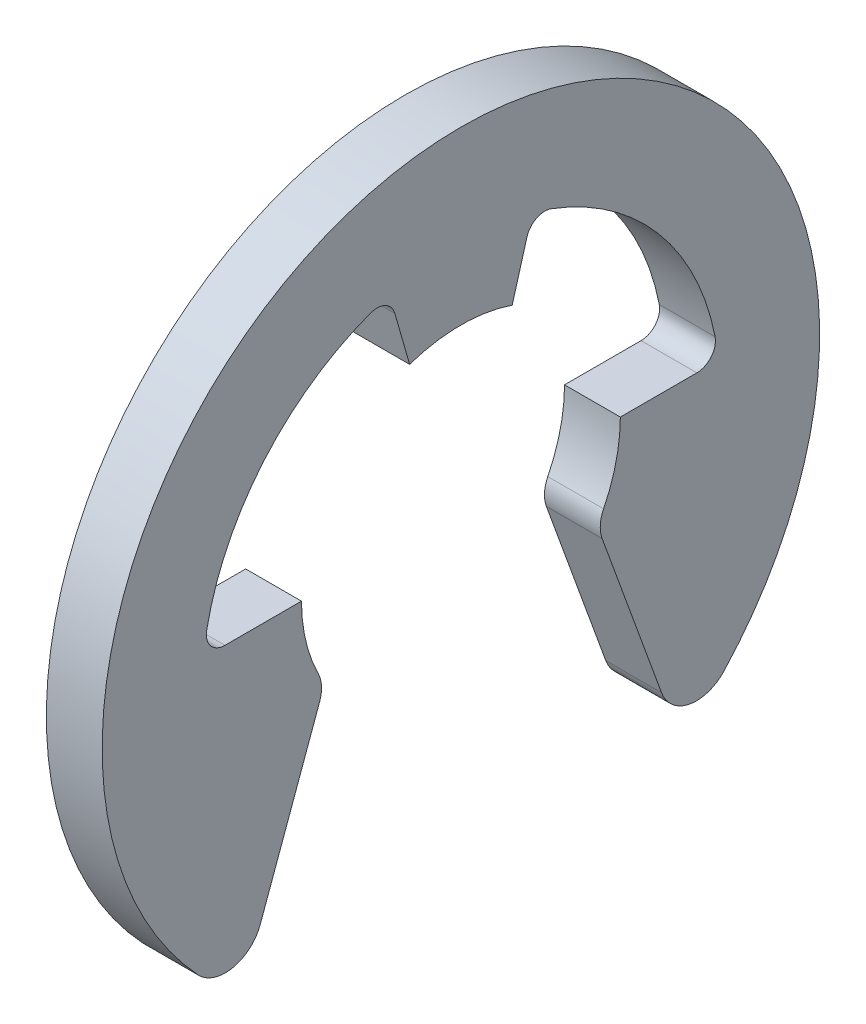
ISO-10303-21;
HEADER;
FILE_DESCRIPTION(('STEP AP214'),'2;1');
FILE_NAME('part.step','',(''),(''),'','','');
FILE_SCHEMA(('AUTOMOTIVE_DESIGN { 1 0 10303 214 1 1 1 1 }'));
ENDSEC;
DATA;
#1=APPLICATION_CONTEXT('core data for automotive mechanical design processes');
#2=APPLICATION_PROTOCOL_DEFINITION('international standard','automotive_design',2000,#1);
#3=PRODUCT_CONTEXT('',#1,'mechanical');
#4=PRODUCT('Part','Part','',(#3));
#5=PRODUCT_RELATED_PRODUCT_CATEGORY('part','',(#4));
#6=PRODUCT_DEFINITION_FORMATION('','',#4);
#7=PRODUCT_DEFINITION_CONTEXT('part definition',#1,'design');
#8=PRODUCT_DEFINITION('design','',#6,#7);
#9=PRODUCT_DEFINITION_SHAPE('','',#8);
#10=(LENGTH_UNIT() NAMED_UNIT(*) SI_UNIT(.MILLI.,.METRE.));
#11=(NAMED_UNIT(*) PLANE_ANGLE_UNIT() SI_UNIT($,.RADIAN.));
#12=(NAMED_UNIT(*) SI_UNIT($,.STERADIAN.) SOLID_ANGLE_UNIT());
#13=UNCERTAINTY_MEASURE_WITH_UNIT(LENGTH_MEASURE(1.E-05),#10,'distance_accuracy_value','');
#14=(GEOMETRIC_REPRESENTATION_CONTEXT(3) GLOBAL_UNCERTAINTY_ASSIGNED_CONTEXT((#13)) GLOBAL_UNIT_ASSIGNED_CONTEXT((#10,
#11,#12)) REPRESENTATION_CONTEXT('',''));
#15=CARTESIAN_POINT('',(0.,0.,0.));
#16=DIRECTION('',(0.,0.,1.));
#17=DIRECTION('',(1.,0.,0.));
#18=AXIS2_PLACEMENT_3D('',#15,#16,#17);
#19=CARTESIAN_POINT('',(0.7,0.583333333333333,-2.95972971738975));
#20=DIRECTION('',(-1.,0.,0.));
#21=DIRECTION('',(0.,0.,1.));
#22=AXIS2_PLACEMENT_3D('',#19,#20,#21);
#23=CYLINDRICAL_SURFACE('',#22,0.233333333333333);
#24=CARTESIAN_POINT('',(0.,0.583333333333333,-2.95972971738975));
#25=DIRECTION('',(-1.,0.,0.));
#26=DIRECTION('',(0.,0.,1.));
#27=AXIS2_PLACEMENT_3D('',#24,#25,#26);
#28=CIRCLE('',#27,0.233333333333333);
#29=CARTESIAN_POINT('',(0.,0.628453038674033,-3.18865908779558));
#30=VERTEX_POINT('',#29);
#31=CARTESIAN_POINT('',(0.,0.35,-2.95972971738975));
#32=VERTEX_POINT('',#31);
#33=EDGE_CURVE('E508',#30,#32,#28,.T.);
#34=ORIENTED_EDGE('',*,*,#33,.T.);
#35=DIRECTION('',(-1.,0.,0.));
#36=VECTOR('',#35,1.);
#37=CARTESIAN_POINT('',(0.7,0.35,-2.95972971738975));
#38=LINE('',#37,#36);
#39=CARTESIAN_POINT('',(0.7,0.35,-2.95972971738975));
#40=VERTEX_POINT('',#39);
#41=EDGE_CURVE('E11',#40,#32,#38,.T.);
#42=ORIENTED_EDGE('',*,*,#41,.F.);
#43=CARTESIAN_POINT('',(0.7,0.583333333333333,-2.95972971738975));
#44=DIRECTION('',(-1.,0.,0.));
#45=DIRECTION('',(0.,0.,1.));
#46=AXIS2_PLACEMENT_3D('',#43,#44,#45);
#47=CIRCLE('',#46,0.233333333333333);
#48=CARTESIAN_POINT('',(0.7,0.628453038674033,-3.18865908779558));
#49=VERTEX_POINT('',#48);
#50=EDGE_CURVE('E567',#49,#40,#47,.T.);
#51=ORIENTED_EDGE('',*,*,#50,.F.);
#52=DIRECTION('',(-1.,0.,0.));
#53=VECTOR('',#52,1.);
#54=CARTESIAN_POINT('',(0.7,0.628453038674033,-3.18865908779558));
#55=LINE('',#54,#53);
#56=EDGE_CURVE('E376',#49,#30,#55,.T.);
#57=ORIENTED_EDGE('',*,*,#56,.T.);
#58=EDGE_LOOP('',(#34,#42,#51,#57));
#59=FACE_BOUND('',#58,.T.);
#60=ADVANCED_FACE('F362',(#59),#23,.F.);
#61=CARTESIAN_POINT('',(0.7,0.35,-2.));
#62=DIRECTION('',(0.,1.,0.));
#63=DIRECTION('',(0.,0.,1.));
#64=AXIS2_PLACEMENT_3D('',#61,#62,#63);
#65=PLANE('',#64);
#66=DIRECTION('',(0.,0.,-1.));
#67=VECTOR('',#66,1.);
#68=CARTESIAN_POINT('',(0.,0.35,-2.));
#69=LINE('',#68,#67);
#70=CARTESIAN_POINT('',(0.,0.35,-2.));
#71=VERTEX_POINT('',#70);
#72=EDGE_CURVE('E503',#71,#32,#69,.T.);
#73=ORIENTED_EDGE('',*,*,#72,.F.);
#74=DIRECTION('',(-1.,0.,0.));
#75=VECTOR('',#74,1.);
#76=CARTESIAN_POINT('',(0.7,0.35,-2.));
#77=LINE('',#76,#75);
#78=CARTESIAN_POINT('',(0.7,0.35,-2.));
#79=VERTEX_POINT('',#78);
#80=EDGE_CURVE('E369',#79,#71,#77,.T.);
#81=ORIENTED_EDGE('',*,*,#80,.F.);
#82=DIRECTION('',(0.,0.,-1.));
#83=VECTOR('',#82,1.);
#84=CARTESIAN_POINT('',(0.7,0.35,-2.));
#85=LINE('',#84,#83);
#86=EDGE_CURVE('E505',#79,#40,#85,.T.);
#87=ORIENTED_EDGE('',*,*,#86,.T.);
#88=ORIENTED_EDGE('',*,*,#41,.T.);
#89=EDGE_LOOP('',(#73,#81,#87,#88));
#90=FACE_BOUND('',#89,.T.);
#91=ADVANCED_FACE('F501',(#90),#65,.T.);
#92=CARTESIAN_POINT('',(0.7,0.35,0.));
#93=DIRECTION('',(-1.,0.,0.));
#94=DIRECTION('',(0.,0.,1.));
#95=AXIS2_PLACEMENT_3D('',#92,#93,#94);
#96=CYLINDRICAL_SURFACE('',#95,2.);
#97=CARTESIAN_POINT('',(0.,0.35,0.));
#98=DIRECTION('',(-1.,0.,0.));
#99=DIRECTION('',(0.,0.,1.));
#100=AXIS2_PLACEMENT_3D('',#97,#98,#99);
#101=CIRCLE('',#100,2.);
#102=CARTESIAN_POINT('',(0.,-0.542190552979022,-1.7899709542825));
#103=VERTEX_POINT('',#102);
#104=EDGE_CURVE('E516',#71,#103,#101,.T.);
#105=ORIENTED_EDGE('',*,*,#104,.T.);
#106=DIRECTION('',(-1.,0.,0.));
#107=VECTOR('',#106,1.);
#108=CARTESIAN_POINT('',(0.7,-0.542190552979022,-1.7899709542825));
#109=LINE('',#108,#107);
#110=CARTESIAN_POINT('',(0.7,-0.542190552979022,-1.7899709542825));
#111=VERTEX_POINT('',#110);
#112=EDGE_CURVE('E647',#111,#103,#109,.T.);
#113=ORIENTED_EDGE('',*,*,#112,.F.);
#114=CARTESIAN_POINT('',(0.7,0.35,0.));
#115=DIRECTION('',(-1.,0.,0.));
#116=DIRECTION('',(0.,0.,1.));
#117=AXIS2_PLACEMENT_3D('',#114,#115,#116);
#118=CIRCLE('',#117,2.);
#119=EDGE_CURVE('E570',#79,#111,#118,.T.);
#120=ORIENTED_EDGE('',*,*,#119,.F.);
#121=ORIENTED_EDGE('',*,*,#80,.T.);
#122=EDGE_LOOP('',(#105,#113,#120,#121));
#123=FACE_BOUND('',#122,.T.);
#124=ADVANCED_FACE('F650',(#123),#96,.F.);
#125=CARTESIAN_POINT('',(0.7,-0.720628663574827,-2.14796514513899));
#126=DIRECTION('',(-1.,0.,0.));
#127=DIRECTION('',(0.,0.,1.));
#128=AXIS2_PLACEMENT_3D('',#125,#126,#127);
#129=CYLINDRICAL_SURFACE('',#128,0.399999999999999);
#130=CARTESIAN_POINT('',(0.,-0.720628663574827,-2.14796514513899));
#131=DIRECTION('',(-1.,0.,0.));
#132=DIRECTION('',(0.,0.,1.));
#133=AXIS2_PLACEMENT_3D('',#130,#131,#132);
#134=CIRCLE('',#133,0.399999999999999);
#135=CARTESIAN_POINT('',(0.,-0.857436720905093,-1.77208809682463));
#136=VERTEX_POINT('',#135);
#137=EDGE_CURVE('E518',#136,#103,#134,.T.);
#138=ORIENTED_EDGE('',*,*,#137,.F.);
#139=DIRECTION('',(-1.,0.,0.));
#140=VECTOR('',#139,1.);
#141=CARTESIAN_POINT('',(0.7,-0.857436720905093,-1.77208809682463));
#142=LINE('',#141,#140);
#143=CARTESIAN_POINT('',(0.7,-0.857436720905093,-1.77208809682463));
#144=VERTEX_POINT('',#143);
#145=EDGE_CURVE('E645',#144,#136,#142,.T.);
#146=ORIENTED_EDGE('',*,*,#145,.F.);
#147=CARTESIAN_POINT('',(0.7,-0.720628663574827,-2.14796514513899));
#148=DIRECTION('',(-1.,0.,0.));
#149=DIRECTION('',(0.,0.,1.));
#150=AXIS2_PLACEMENT_3D('',#147,#148,#149);
#151=CIRCLE('',#150,0.399999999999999);
#152=EDGE_CURVE('E572',#144,#111,#151,.T.);
#153=ORIENTED_EDGE('',*,*,#152,.T.);
#154=ORIENTED_EDGE('',*,*,#112,.T.);
#155=EDGE_LOOP('',(#138,#146,#153,#154));
#156=FACE_BOUND('',#155,.T.);
#157=ADVANCED_FACE('F721',(#156),#129,.T.);
#158=CARTESIAN_POINT('',(0.7,-0.857436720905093,-1.77208809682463));
#159=DIRECTION('',(0.,0.34202014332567,-0.939692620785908));
#160=DIRECTION('',(0.,0.939692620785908,0.34202014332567));
#161=AXIS2_PLACEMENT_3D('',#158,#159,#160);
#162=PLANE('',#161);
#163=DIRECTION('',(0.,-0.939692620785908,-0.34202014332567));
#164=VECTOR('',#163,1.);
#165=CARTESIAN_POINT('',(0.,-0.857436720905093,-1.77208809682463));
#166=LINE('',#165,#164);
#167=CARTESIAN_POINT('',(0.,-2.90414673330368,-2.51702961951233));
#168=VERTEX_POINT('',#167);
#169=EDGE_CURVE('E522',#136,#168,#166,.T.);
#170=ORIENTED_EDGE('',*,*,#169,.T.);
#171=DIRECTION('',(-1.,0.,0.));
#172=VECTOR('',#171,1.);
#173=CARTESIAN_POINT('',(0.7,-2.90414673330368,-2.51702961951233));
#174=LINE('',#173,#172);
#175=CARTESIAN_POINT('',(0.7,-2.90414673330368,-2.51702961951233));
#176=VERTEX_POINT('',#175);
#177=EDGE_CURVE('E643',#176,#168,#174,.T.);
#178=ORIENTED_EDGE('',*,*,#177,.F.);
#179=DIRECTION('',(0.,-0.939692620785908,-0.34202014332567));
#180=VECTOR('',#179,1.);
#181=CARTESIAN_POINT('',(0.7,-0.857436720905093,-1.77208809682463));
#182=LINE('',#181,#180);
#183=EDGE_CURVE('E575',#144,#176,#182,.T.);
#184=ORIENTED_EDGE('',*,*,#183,.F.);
#185=ORIENTED_EDGE('',*,*,#145,.T.);
#186=EDGE_LOOP('',(#170,#178,#184,#185));
#187=FACE_BOUND('',#186,.T.);
#188=ADVANCED_FACE('F718',(#187),#162,.F.);
#189=CARTESIAN_POINT('',(0.7,-2.74453733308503,-2.95555284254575));
#190=DIRECTION('',(-1.,0.,0.));
#191=DIRECTION('',(0.,0.,1.));
#192=AXIS2_PLACEMENT_3D('',#189,#190,#191);
#193=CYLINDRICAL_SURFACE('',#192,0.466666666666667);
#194=CARTESIAN_POINT('',(0.,-2.74453733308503,-2.95555284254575));
#195=DIRECTION('',(-1.,0.,0.));
#196=DIRECTION('',(0.,0.,1.));
#197=AXIS2_PLACEMENT_3D('',#194,#195,#196);
#198=CIRCLE('',#197,0.466666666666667);
#199=CARTESIAN_POINT('',(0.,-3.06208710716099,-3.29751763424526));
#200=VERTEX_POINT('',#199);
#201=EDGE_CURVE('E525',#200,#168,#198,.T.);
#202=ORIENTED_EDGE('',*,*,#201,.F.);
#203=DIRECTION('',(-1.,0.,0.));
#204=VECTOR('',#203,1.);
#205=CARTESIAN_POINT('',(0.7,-3.06208710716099,-3.29751763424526));
#206=LINE('',#205,#204);
#207=CARTESIAN_POINT('',(0.7,-3.06208710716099,-3.29751763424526));
#208=VERTEX_POINT('',#207);
#209=EDGE_CURVE('E641',#208,#200,#206,.T.);
#210=ORIENTED_EDGE('',*,*,#209,.F.);
#211=CARTESIAN_POINT('',(0.7,-2.74453733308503,-2.95555284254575));
#212=DIRECTION('',(-1.,0.,0.));
#213=DIRECTION('',(0.,0.,1.));
#214=AXIS2_PLACEMENT_3D('',#211,#212,#213);
#215=CIRCLE('',#214,0.466666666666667);
#216=EDGE_CURVE('E577',#208,#176,#215,.T.);
#217=ORIENTED_EDGE('',*,*,#216,.T.);
#218=ORIENTED_EDGE('',*,*,#177,.T.);
#219=EDGE_LOOP('',(#202,#210,#217,#218));
#220=FACE_BOUND('',#219,.T.);
#221=ADVANCED_FACE('F712',(#220),#193,.T.);
#222=CARTESIAN_POINT('',(0.7,0.,0.));
#223=DIRECTION('',(-1.,0.,0.));
#224=DIRECTION('',(0.,0.,1.));
#225=AXIS2_PLACEMENT_3D('',#222,#223,#224);
#226=CYLINDRICAL_SURFACE('',#225,4.5);
#227=CARTESIAN_POINT('',(0.,0.,0.));
#228=DIRECTION('',(1.,0.,0.));
#229=DIRECTION('',(0.,0.,-1.));
#230=AXIS2_PLACEMENT_3D('',#227,#228,#229);
#231=CIRCLE('',#230,4.5);
#232=CARTESIAN_POINT('',(0.,-3.06208710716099,3.29751763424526));
#233=VERTEX_POINT('',#232);
#234=EDGE_CURVE('E528',#200,#233,#231,.T.);
#235=ORIENTED_EDGE('',*,*,#234,.T.);
#236=DIRECTION('',(-1.,0.,0.));
#237=VECTOR('',#236,1.);
#238=CARTESIAN_POINT('',(0.7,-3.06208710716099,3.29751763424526));
#239=LINE('',#238,#237);
#240=CARTESIAN_POINT('',(0.7,-3.06208710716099,3.29751763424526));
#241=VERTEX_POINT('',#240);
#242=EDGE_CURVE('E638',#241,#233,#239,.T.);
#243=ORIENTED_EDGE('',*,*,#242,.F.);
#244=CARTESIAN_POINT('',(0.7,0.,0.));
#245=DIRECTION('',(1.,0.,0.));
#246=DIRECTION('',(0.,0.,-1.));
#247=AXIS2_PLACEMENT_3D('',#244,#245,#246);
#248=CIRCLE('',#247,4.5);
#249=EDGE_CURVE('E580',#208,#241,#248,.T.);
#250=ORIENTED_EDGE('',*,*,#249,.F.);
#251=ORIENTED_EDGE('',*,*,#209,.T.);
#252=EDGE_LOOP('',(#235,#243,#250,#251));
#253=FACE_BOUND('',#252,.T.);
#254=ADVANCED_FACE('F722',(#253),#226,.T.);
#255=CARTESIAN_POINT('',(0.7,-2.74453733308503,2.95555284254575));
#256=DIRECTION('',(-1.,0.,0.));
#257=DIRECTION('',(0.,0.,1.));
#258=AXIS2_PLACEMENT_3D('',#255,#256,#257);
#259=CYLINDRICAL_SURFACE('',#258,0.466666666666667);
#260=CARTESIAN_POINT('',(0.,-2.74453733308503,2.95555284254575));
#261=DIRECTION('',(1.,0.,0.));
#262=DIRECTION('',(0.,0.,-1.));
#263=AXIS2_PLACEMENT_3D('',#260,#261,#262);
#264=CIRCLE('',#263,0.466666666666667);
#265=CARTESIAN_POINT('',(0.,-2.90414673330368,2.51702961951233));
#266=VERTEX_POINT('',#265);
#267=EDGE_CURVE('E530',#233,#266,#264,.T.);
#268=ORIENTED_EDGE('',*,*,#267,.T.);
#269=DIRECTION('',(-1.,0.,0.));
#270=VECTOR('',#269,1.);
#271=CARTESIAN_POINT('',(0.7,-2.90414673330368,2.51702961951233));
#272=LINE('',#271,#270);
#273=CARTESIAN_POINT('',(0.7,-2.90414673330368,2.51702961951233));
#274=VERTEX_POINT('',#273);
#275=EDGE_CURVE('E636',#274,#266,#272,.T.);
#276=ORIENTED_EDGE('',*,*,#275,.F.);
#277=CARTESIAN_POINT('',(0.7,-2.74453733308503,2.95555284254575));
#278=DIRECTION('',(1.,0.,0.));
#279=DIRECTION('',(0.,0.,-1.));
#280=AXIS2_PLACEMENT_3D('',#277,#278,#279);
#281=CIRCLE('',#280,0.466666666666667);
#282=EDGE_CURVE('E582',#241,#274,#281,.T.);
#283=ORIENTED_EDGE('',*,*,#282,.F.);
#284=ORIENTED_EDGE('',*,*,#242,.T.);
#285=EDGE_LOOP('',(#268,#276,#283,#284));
#286=FACE_BOUND('',#285,.T.);
#287=ADVANCED_FACE('F705',(#286),#259,.T.);
#288=CARTESIAN_POINT('',(0.7,-0.857436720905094,1.77208809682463));
#289=DIRECTION('',(0.,-0.34202014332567,-0.939692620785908));
#290=DIRECTION('',(0.,0.939692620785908,-0.34202014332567));
#291=AXIS2_PLACEMENT_3D('',#288,#289,#290);
#292=PLANE('',#291);
#293=DIRECTION('',(0.,-0.939692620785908,0.342020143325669));
#294=VECTOR('',#293,1.);
#295=CARTESIAN_POINT('',(0.,-0.857436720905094,1.77208809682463));
#296=LINE('',#295,#294);
#297=CARTESIAN_POINT('',(0.,-0.857436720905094,1.77208809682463));
#298=VERTEX_POINT('',#297);
#299=EDGE_CURVE('E533',#298,#266,#296,.T.);
#300=ORIENTED_EDGE('',*,*,#299,.F.);
#301=DIRECTION('',(-1.,0.,0.));
#302=VECTOR('',#301,1.);
#303=CARTESIAN_POINT('',(0.7,-0.857436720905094,1.77208809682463));
#304=LINE('',#303,#302);
#305=CARTESIAN_POINT('',(0.7,-0.857436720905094,1.77208809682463));
#306=VERTEX_POINT('',#305);
#307=EDGE_CURVE('E634',#306,#298,#304,.T.);
#308=ORIENTED_EDGE('',*,*,#307,.F.);
#309=DIRECTION('',(0.,-0.939692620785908,0.342020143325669));
#310=VECTOR('',#309,1.);
#311=CARTESIAN_POINT('',(0.7,-0.857436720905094,1.77208809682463));
#312=LINE('',#311,#310);
#313=EDGE_CURVE('E584',#306,#274,#312,.T.);
#314=ORIENTED_EDGE('',*,*,#313,.T.);
#315=ORIENTED_EDGE('',*,*,#275,.T.);
#316=EDGE_LOOP('',(#300,#308,#314,#315));
#317=FACE_BOUND('',#316,.T.);
#318=ADVANCED_FACE('F700',(#317),#292,.T.);
#319=CARTESIAN_POINT('',(0.7,-0.720628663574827,2.14796514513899));
#320=DIRECTION('',(-1.,0.,0.));
#321=DIRECTION('',(0.,0.,1.));
#322=AXIS2_PLACEMENT_3D('',#319,#320,#321);
#323=CYLINDRICAL_SURFACE('',#322,0.399999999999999);
#324=CARTESIAN_POINT('',(0.,-0.720628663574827,2.14796514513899));
#325=DIRECTION('',(1.,0.,0.));
#326=DIRECTION('',(0.,0.,-1.));
#327=AXIS2_PLACEMENT_3D('',#324,#325,#326);
#328=CIRCLE('',#327,0.399999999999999);
#329=CARTESIAN_POINT('',(0.,-0.542190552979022,1.7899709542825));
#330=VERTEX_POINT('',#329);
#331=EDGE_CURVE('E536',#298,#330,#328,.T.);
#332=ORIENTED_EDGE('',*,*,#331,.T.);
#333=DIRECTION('',(-1.,0.,0.));
#334=VECTOR('',#333,1.);
#335=CARTESIAN_POINT('',(0.7,-0.542190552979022,1.7899709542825));
#336=LINE('',#335,#334);
#337=CARTESIAN_POINT('',(0.7,-0.542190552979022,1.7899709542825));
#338=VERTEX_POINT('',#337);
#339=EDGE_CURVE('E632',#338,#330,#336,.T.);
#340=ORIENTED_EDGE('',*,*,#339,.F.);
#341=CARTESIAN_POINT('',(0.7,-0.720628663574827,2.14796514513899));
#342=DIRECTION('',(1.,0.,0.));
#343=DIRECTION('',(0.,0.,-1.));
#344=AXIS2_PLACEMENT_3D('',#341,#342,#343);
#345=CIRCLE('',#344,0.399999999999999);
#346=EDGE_CURVE('E587',#306,#338,#345,.T.);
#347=ORIENTED_EDGE('',*,*,#346,.F.);
#348=ORIENTED_EDGE('',*,*,#307,.T.);
#349=EDGE_LOOP('',(#332,#340,#347,#348));
#350=FACE_BOUND('',#349,.T.);
#351=ADVANCED_FACE('F696',(#350),#323,.T.);
#352=CARTESIAN_POINT('',(0.7,0.35,0.));
#353=DIRECTION('',(-1.,0.,0.));
#354=DIRECTION('',(0.,0.,1.));
#355=AXIS2_PLACEMENT_3D('',#352,#353,#354);
#356=CYLINDRICAL_SURFACE('',#355,2.);
#357=CARTESIAN_POINT('',(0.,0.35,0.));
#358=DIRECTION('',(1.,0.,0.));
#359=DIRECTION('',(0.,0.,-1.));
#360=AXIS2_PLACEMENT_3D('',#357,#358,#359);
#361=CIRCLE('',#360,2.);
#362=CARTESIAN_POINT('',(0.,0.35,2.));
#363=VERTEX_POINT('',#362);
#364=EDGE_CURVE('E539',#363,#330,#361,.T.);
#365=ORIENTED_EDGE('',*,*,#364,.F.);
#366=DIRECTION('',(-1.,0.,0.));
#367=VECTOR('',#366,1.);
#368=CARTESIAN_POINT('',(0.7,0.35,2.));
#369=LINE('',#368,#367);
#370=CARTESIAN_POINT('',(0.7,0.35,2.));
#371=VERTEX_POINT('',#370);
#372=EDGE_CURVE('E630',#371,#363,#369,.T.);
#373=ORIENTED_EDGE('',*,*,#372,.F.);
#374=CARTESIAN_POINT('',(0.7,0.35,0.));
#375=DIRECTION('',(1.,0.,0.));
#376=DIRECTION('',(0.,0.,-1.));
#377=AXIS2_PLACEMENT_3D('',#374,#375,#376);
#378=CIRCLE('',#377,2.);
#379=EDGE_CURVE('E589',#371,#338,#378,.T.);
#380=ORIENTED_EDGE('',*,*,#379,.T.);
#381=ORIENTED_EDGE('',*,*,#339,.T.);
#382=EDGE_LOOP('',(#365,#373,#380,#381));
#383=FACE_BOUND('',#382,.T.);
#384=ADVANCED_FACE('F690',(#383),#356,.F.);
#385=CARTESIAN_POINT('',(0.7,0.35,2.));
#386=DIRECTION('',(0.,-1.,0.));
#387=DIRECTION('',(0.,0.,-1.));
#388=AXIS2_PLACEMENT_3D('',#385,#386,#387);
#389=PLANE('',#388);
#390=DIRECTION('',(0.,0.,1.));
#391=VECTOR('',#390,1.);
#392=CARTESIAN_POINT('',(0.,0.35,2.));
#393=LINE('',#392,#391);
#394=CARTESIAN_POINT('',(0.,0.349999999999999,2.95972971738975));
#395=VERTEX_POINT('',#394);
#396=EDGE_CURVE('E542',#363,#395,#393,.T.);
#397=ORIENTED_EDGE('',*,*,#396,.T.);
#398=DIRECTION('',(-1.,0.,0.));
#399=VECTOR('',#398,1.);
#400=CARTESIAN_POINT('',(0.7,0.349999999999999,2.95972971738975));
#401=LINE('',#400,#399);
#402=CARTESIAN_POINT('',(0.7,0.349999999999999,2.95972971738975));
#403=VERTEX_POINT('',#402);
#404=EDGE_CURVE('E628',#403,#395,#401,.T.);
#405=ORIENTED_EDGE('',*,*,#404,.F.);
#406=DIRECTION('',(0.,0.,1.));
#407=VECTOR('',#406,1.);
#408=CARTESIAN_POINT('',(0.7,0.35,2.));
#409=LINE('',#408,#407);
#410=EDGE_CURVE('E592',#371,#403,#409,.T.);
#411=ORIENTED_EDGE('',*,*,#410,.F.);
#412=ORIENTED_EDGE('',*,*,#372,.T.);
#413=EDGE_LOOP('',(#397,#405,#411,#412));
#414=FACE_BOUND('',#413,.T.);
#415=ADVANCED_FACE('F776',(#414),#389,.F.);
#416=CARTESIAN_POINT('',(0.7,0.583333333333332,2.95972971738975));
#417=DIRECTION('',(-1.,0.,0.));
#418=DIRECTION('',(0.,0.,1.));
#419=AXIS2_PLACEMENT_3D('',#416,#417,#418);
#420=CYLINDRICAL_SURFACE('',#419,0.233333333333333);
#421=CARTESIAN_POINT('',(0.,0.583333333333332,2.95972971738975));
#422=DIRECTION('',(1.,0.,0.));
#423=DIRECTION('',(0.,0.,-1.));
#424=AXIS2_PLACEMENT_3D('',#421,#422,#423);
#425=CIRCLE('',#424,0.233333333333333);
#426=CARTESIAN_POINT('',(0.,0.628453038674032,3.18865908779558));
#427=VERTEX_POINT('',#426);
#428=EDGE_CURVE('E545',#427,#395,#425,.T.);
#429=ORIENTED_EDGE('',*,*,#428,.F.);
#430=DIRECTION('',(-1.,0.,0.));
#431=VECTOR('',#430,1.);
#432=CARTESIAN_POINT('',(0.7,0.628453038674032,3.18865908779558));
#433=LINE('',#432,#431);
#434=CARTESIAN_POINT('',(0.7,0.628453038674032,3.18865908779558));
#435=VERTEX_POINT('',#434);
#436=EDGE_CURVE('E626',#435,#427,#433,.T.);
#437=ORIENTED_EDGE('',*,*,#436,.F.);
#438=CARTESIAN_POINT('',(0.7,0.583333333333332,2.95972971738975));
#439=DIRECTION('',(1.,0.,0.));
#440=DIRECTION('',(0.,0.,-1.));
#441=AXIS2_PLACEMENT_3D('',#438,#439,#440);
#442=CIRCLE('',#441,0.233333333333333);
#443=EDGE_CURVE('E594',#435,#403,#442,.T.);
#444=ORIENTED_EDGE('',*,*,#443,.T.);
#445=ORIENTED_EDGE('',*,*,#404,.T.);
#446=EDGE_LOOP('',(#429,#437,#444,#445));
#447=FACE_BOUND('',#446,.T.);
#448=ADVANCED_FACE('F683',(#447),#420,.F.);
#449=CARTESIAN_POINT('',(0.7,0.,0.));
#450=DIRECTION('',(-1.,0.,0.));
#451=DIRECTION('',(0.,0.,1.));
#452=AXIS2_PLACEMENT_3D('',#449,#450,#451);
#453=CYLINDRICAL_SURFACE('',#452,3.25);
#454=CARTESIAN_POINT('',(0.,0.,0.));
#455=DIRECTION('',(-1.,0.,0.));
#456=DIRECTION('',(0.,0.,1.));
#457=AXIS2_PLACEMENT_3D('',#454,#455,#456);
#458=CIRCLE('',#457,3.25);
#459=CARTESIAN_POINT('',(0.,3.04545112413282,1.13478079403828));
#460=VERTEX_POINT('',#459);
#461=EDGE_CURVE('E548',#427,#460,#458,.T.);
#462=ORIENTED_EDGE('',*,*,#461,.T.);
#463=DIRECTION('',(-1.,0.,0.));
#464=VECTOR('',#463,1.);
#465=CARTESIAN_POINT('',(0.7,3.04545112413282,1.13478079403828));
#466=LINE('',#465,#464);
#467=CARTESIAN_POINT('',(0.7,3.04545112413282,1.13478079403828));
#468=VERTEX_POINT('',#467);
#469=EDGE_CURVE('E623',#468,#460,#466,.T.);
#470=ORIENTED_EDGE('',*,*,#469,.F.);
#471=CARTESIAN_POINT('',(0.7,0.,0.));
#472=DIRECTION('',(-1.,0.,0.));
#473=DIRECTION('',(0.,0.,1.));
#474=AXIS2_PLACEMENT_3D('',#471,#472,#473);
#475=CIRCLE('',#474,3.25);
#476=EDGE_CURVE('E597',#435,#468,#475,.T.);
#477=ORIENTED_EDGE('',*,*,#476,.F.);
#478=ORIENTED_EDGE('',*,*,#436,.T.);
#479=EDGE_LOOP('',(#462,#470,#477,#478));
#480=FACE_BOUND('',#479,.T.);
#481=ADVANCED_FACE('F680',(#480),#453,.F.);
#482=CARTESIAN_POINT('',(0.7,2.82680335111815,1.05330935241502));
#483=DIRECTION('',(-1.,0.,0.));
#484=DIRECTION('',(0.,0.,1.));
#485=AXIS2_PLACEMENT_3D('',#482,#483,#484);
#486=CYLINDRICAL_SURFACE('',#485,0.233333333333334);
#487=CARTESIAN_POINT('',(0.,2.82680335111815,1.05330935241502));
#488=DIRECTION('',(-1.,0.,0.));
#489=DIRECTION('',(0.,0.,1.));
#490=AXIS2_PLACEMENT_3D('',#487,#488,#489);
#491=CIRCLE('',#490,0.233333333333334);
#492=CARTESIAN_POINT('',(0.,2.89111873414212,0.829014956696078));
#493=VERTEX_POINT('',#492);
#494=EDGE_CURVE('E550',#460,#493,#491,.T.);
#495=ORIENTED_EDGE('',*,*,#494,.T.);
#496=DIRECTION('',(-1.,0.,0.));
#497=VECTOR('',#496,1.);
#498=CARTESIAN_POINT('',(0.7,2.89111873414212,0.829014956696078));
#499=LINE('',#498,#497);
#500=CARTESIAN_POINT('',(0.7,2.89111873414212,0.829014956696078));
#501=VERTEX_POINT('',#500);
#502=EDGE_CURVE('E621',#501,#493,#499,.T.);
#503=ORIENTED_EDGE('',*,*,#502,.F.);
#504=CARTESIAN_POINT('',(0.7,2.82680335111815,1.05330935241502));
#505=DIRECTION('',(-1.,0.,0.));
#506=DIRECTION('',(0.,0.,1.));
#507=AXIS2_PLACEMENT_3D('',#504,#505,#506);
#508=CIRCLE('',#507,0.233333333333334);
#509=EDGE_CURVE('E599',#468,#501,#508,.T.);
#510=ORIENTED_EDGE('',*,*,#509,.F.);
#511=ORIENTED_EDGE('',*,*,#469,.T.);
#512=EDGE_LOOP('',(#495,#503,#510,#511));
#513=FACE_BOUND('',#512,.T.);
#514=ADVANCED_FACE('F675',(#513),#486,.F.);
#515=CARTESIAN_POINT('',(0.7,2.24369387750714,0.643368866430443));
#516=DIRECTION('',(0.,-0.275637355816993,0.961261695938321));
#517=DIRECTION('',(0.,-0.961261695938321,-0.275637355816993));
#518=AXIS2_PLACEMENT_3D('',#515,#516,#517);
#519=PLANE('',#518);
#520=DIRECTION('',(0.,0.961261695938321,0.275637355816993));
#521=VECTOR('',#520,1.);
#522=CARTESIAN_POINT('',(0.,2.24369387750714,0.643368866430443));
#523=LINE('',#522,#521);
#524=CARTESIAN_POINT('',(0.,2.24369387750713,0.643368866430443));
#525=VERTEX_POINT('',#524);
#526=EDGE_CURVE('E553',#525,#493,#523,.T.);
#527=ORIENTED_EDGE('',*,*,#526,.F.);
#528=DIRECTION('',(-1.,0.,0.));
#529=VECTOR('',#528,1.);
#530=CARTESIAN_POINT('',(0.7,2.24369387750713,0.643368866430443));
#531=LINE('',#530,#529);
#532=CARTESIAN_POINT('',(0.7,2.24369387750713,0.643368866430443));
#533=VERTEX_POINT('',#532);
#534=EDGE_CURVE('E619',#533,#525,#531,.T.);
#535=ORIENTED_EDGE('',*,*,#534,.F.);
#536=DIRECTION('',(0.,0.961261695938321,0.275637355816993));
#537=VECTOR('',#536,1.);
#538=CARTESIAN_POINT('',(0.7,2.24369387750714,0.643368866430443));
#539=LINE('',#538,#537);
#540=EDGE_CURVE('E601',#533,#501,#539,.T.);
#541=ORIENTED_EDGE('',*,*,#540,.T.);
#542=ORIENTED_EDGE('',*,*,#502,.T.);
#543=EDGE_LOOP('',(#527,#535,#541,#542));
#544=FACE_BOUND('',#543,.T.);
#545=ADVANCED_FACE('F669',(#544),#519,.T.);
#546=CARTESIAN_POINT('',(0.7,0.35,0.));
#547=DIRECTION('',(-1.,0.,0.));
#548=DIRECTION('',(0.,0.,1.));
#549=AXIS2_PLACEMENT_3D('',#546,#547,#548);
#550=CYLINDRICAL_SURFACE('',#549,2.);
#551=CARTESIAN_POINT('',(0.,0.35,0.));
#552=DIRECTION('',(1.,0.,0.));
#553=DIRECTION('',(0.,0.,-1.));
#554=AXIS2_PLACEMENT_3D('',#551,#552,#553);
#555=CIRCLE('',#554,2.);
#556=CARTESIAN_POINT('',(0.,2.24369387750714,-0.643368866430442));
#557=VERTEX_POINT('',#556);
#558=EDGE_CURVE('E556',#557,#525,#555,.T.);
#559=ORIENTED_EDGE('',*,*,#558,.F.);
#560=DIRECTION('',(-1.,0.,0.));
#561=VECTOR('',#560,1.);
#562=CARTESIAN_POINT('',(0.7,2.24369387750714,-0.643368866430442));
#563=LINE('',#562,#561);
#564=CARTESIAN_POINT('',(0.7,2.24369387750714,-0.643368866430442));
#565=VERTEX_POINT('',#564);
#566=EDGE_CURVE('E617',#565,#557,#563,.T.);
#567=ORIENTED_EDGE('',*,*,#566,.F.);
#568=CARTESIAN_POINT('',(0.7,0.35,0.));
#569=DIRECTION('',(1.,0.,0.));
#570=DIRECTION('',(0.,0.,-1.));
#571=AXIS2_PLACEMENT_3D('',#568,#569,#570);
#572=CIRCLE('',#571,2.);
#573=EDGE_CURVE('E604',#565,#533,#572,.T.);
#574=ORIENTED_EDGE('',*,*,#573,.T.);
#575=ORIENTED_EDGE('',*,*,#534,.T.);
#576=EDGE_LOOP('',(#559,#567,#574,#575));
#577=FACE_BOUND('',#576,.T.);
#578=ADVANCED_FACE('F663',(#577),#550,.F.);
#579=CARTESIAN_POINT('',(0.7,2.24369387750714,-0.643368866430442));
#580=DIRECTION('',(0.,0.275637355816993,0.961261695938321));
#581=DIRECTION('',(0.,-0.961261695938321,0.275637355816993));
#582=AXIS2_PLACEMENT_3D('',#579,#580,#581);
#583=PLANE('',#582);
#584=DIRECTION('',(0.,0.961261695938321,-0.275637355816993));
#585=VECTOR('',#584,1.);
#586=CARTESIAN_POINT('',(0.,2.24369387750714,-0.643368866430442));
#587=LINE('',#586,#585);
#588=CARTESIAN_POINT('',(0.,2.89111873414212,-0.829014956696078));
#589=VERTEX_POINT('',#588);
#590=EDGE_CURVE('E559',#557,#589,#587,.T.);
#591=ORIENTED_EDGE('',*,*,#590,.T.);
#592=DIRECTION('',(-1.,0.,0.));
#593=VECTOR('',#592,1.);
#594=CARTESIAN_POINT('',(0.7,2.89111873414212,-0.829014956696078));
#595=LINE('',#594,#593);
#596=CARTESIAN_POINT('',(0.7,2.89111873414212,-0.829014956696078));
#597=VERTEX_POINT('',#596);
#598=EDGE_CURVE('E615',#597,#589,#595,.T.);
#599=ORIENTED_EDGE('',*,*,#598,.F.);
#600=DIRECTION('',(0.,0.961261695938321,-0.275637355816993));
#601=VECTOR('',#600,1.);
#602=CARTESIAN_POINT('',(0.7,2.24369387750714,-0.643368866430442));
#603=LINE('',#602,#601);
#604=EDGE_CURVE('E607',#565,#597,#603,.T.);
#605=ORIENTED_EDGE('',*,*,#604,.F.);
#606=ORIENTED_EDGE('',*,*,#566,.T.);
#607=EDGE_LOOP('',(#591,#599,#605,#606));
#608=FACE_BOUND('',#607,.T.);
#609=ADVANCED_FACE('F813',(#608),#583,.F.);
#610=CARTESIAN_POINT('',(0.7,2.82680335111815,-1.05330935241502));
#611=DIRECTION('',(-1.,0.,0.));
#612=DIRECTION('',(0.,0.,1.));
#613=AXIS2_PLACEMENT_3D('',#610,#611,#612);
#614=CYLINDRICAL_SURFACE('',#613,0.233333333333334);
#615=CARTESIAN_POINT('',(0.,2.82680335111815,-1.05330935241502));
#616=DIRECTION('',(1.,0.,0.));
#617=DIRECTION('',(0.,0.,-1.));
#618=AXIS2_PLACEMENT_3D('',#615,#616,#617);
#619=CIRCLE('',#618,0.233333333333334);
#620=CARTESIAN_POINT('',(0.,3.04545112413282,-1.13478079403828));
#621=VERTEX_POINT('',#620);
#622=EDGE_CURVE('E562',#621,#589,#619,.T.);
#623=ORIENTED_EDGE('',*,*,#622,.F.);
#624=DIRECTION('',(-1.,0.,0.));
#625=VECTOR('',#624,1.);
#626=CARTESIAN_POINT('',(0.7,3.04545112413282,-1.13478079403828));
#627=LINE('',#626,#625);
#628=CARTESIAN_POINT('',(0.7,3.04545112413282,-1.13478079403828));
#629=VERTEX_POINT('',#628);
#630=EDGE_CURVE('E384',#629,#621,#627,.T.);
#631=ORIENTED_EDGE('',*,*,#630,.F.);
#632=CARTESIAN_POINT('',(0.7,2.82680335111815,-1.05330935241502));
#633=DIRECTION('',(1.,0.,0.));
#634=DIRECTION('',(0.,0.,-1.));
#635=AXIS2_PLACEMENT_3D('',#632,#633,#634);
#636=CIRCLE('',#635,0.233333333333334);
#637=EDGE_CURVE('E609',#629,#597,#636,.T.);
#638=ORIENTED_EDGE('',*,*,#637,.T.);
#639=ORIENTED_EDGE('',*,*,#598,.T.);
#640=EDGE_LOOP('',(#623,#631,#638,#639));
#641=FACE_BOUND('',#640,.T.);
#642=ADVANCED_FACE('F657',(#641),#614,.F.);
#643=CARTESIAN_POINT('',(0.7,0.,0.));
#644=DIRECTION('',(-1.,0.,0.));
#645=DIRECTION('',(0.,0.,1.));
#646=AXIS2_PLACEMENT_3D('',#643,#644,#645);
#647=CYLINDRICAL_SURFACE('',#646,3.25);
#648=CARTESIAN_POINT('',(0.,0.,0.));
#649=DIRECTION('',(1.,0.,0.));
#650=DIRECTION('',(0.,0.,-1.));
#651=AXIS2_PLACEMENT_3D('',#648,#649,#650);
#652=CIRCLE('',#651,3.25);
#653=EDGE_CURVE('E565',#30,#621,#652,.T.);
#654=ORIENTED_EDGE('',*,*,#653,.F.);
#655=ORIENTED_EDGE('',*,*,#56,.F.);
#656=CARTESIAN_POINT('',(0.7,0.,0.));
#657=DIRECTION('',(1.,0.,0.));
#658=DIRECTION('',(0.,0.,-1.));
#659=AXIS2_PLACEMENT_3D('',#656,#657,#658);
#660=CIRCLE('',#659,3.25);
#661=EDGE_CURVE('E611',#49,#629,#660,.T.);
#662=ORIENTED_EDGE('',*,*,#661,.T.);
#663=ORIENTED_EDGE('',*,*,#630,.T.);
#664=EDGE_LOOP('',(#654,#655,#662,#663));
#665=FACE_BOUND('',#664,.T.);
#666=ADVANCED_FACE('F656',(#665),#647,.F.);
#667=CARTESIAN_POINT('',(0.7,0.583333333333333,-2.95972971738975));
#668=DIRECTION('',(-1.,0.,0.));
#669=DIRECTION('',(0.,0.,1.));
#670=AXIS2_PLACEMENT_3D('',#667,#668,#669);
#671=PLANE('',#670);
#672=ORIENTED_EDGE('',*,*,#50,.T.);
#673=ORIENTED_EDGE('',*,*,#86,.F.);
#674=ORIENTED_EDGE('',*,*,#119,.T.);
#675=ORIENTED_EDGE('',*,*,#152,.F.);
#676=ORIENTED_EDGE('',*,*,#183,.T.);
#677=ORIENTED_EDGE('',*,*,#216,.F.);
#678=ORIENTED_EDGE('',*,*,#249,.T.);
#679=ORIENTED_EDGE('',*,*,#282,.T.);
#680=ORIENTED_EDGE('',*,*,#313,.F.);
#681=ORIENTED_EDGE('',*,*,#346,.T.);
#682=ORIENTED_EDGE('',*,*,#379,.F.);
#683=ORIENTED_EDGE('',*,*,#410,.T.);
#684=ORIENTED_EDGE('',*,*,#443,.F.);
#685=ORIENTED_EDGE('',*,*,#476,.T.);
#686=ORIENTED_EDGE('',*,*,#509,.T.);
#687=ORIENTED_EDGE('',*,*,#540,.F.);
#688=ORIENTED_EDGE('',*,*,#573,.F.);
#689=ORIENTED_EDGE('',*,*,#604,.T.);
#690=ORIENTED_EDGE('',*,*,#637,.F.);
#691=ORIENTED_EDGE('',*,*,#661,.F.);
#692=EDGE_LOOP('',(#672,#673,#674,#675,#676,#677,#678,#679,#680,#681,#682,#683,#684,#685,#686,
#687,#688,#689,#690,#691));
#693=FACE_BOUND('',#692,.T.);
#694=ADVANCED_FACE('F654',(#693),#671,.F.);
#695=CARTESIAN_POINT('',(0.,0.583333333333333,-2.95972971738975));
#696=DIRECTION('',(-1.,0.,0.));
#697=DIRECTION('',(0.,0.,1.));
#698=AXIS2_PLACEMENT_3D('',#695,#696,#697);
#699=PLANE('',#698);
#700=ORIENTED_EDGE('',*,*,#33,.F.);
#701=ORIENTED_EDGE('',*,*,#653,.T.);
#702=ORIENTED_EDGE('',*,*,#622,.T.);
#703=ORIENTED_EDGE('',*,*,#590,.F.);
#704=ORIENTED_EDGE('',*,*,#558,.T.);
#705=ORIENTED_EDGE('',*,*,#526,.T.);
#706=ORIENTED_EDGE('',*,*,#494,.F.);
#707=ORIENTED_EDGE('',*,*,#461,.F.);
#708=ORIENTED_EDGE('',*,*,#428,.T.);
#709=ORIENTED_EDGE('',*,*,#396,.F.);
#710=ORIENTED_EDGE('',*,*,#364,.T.);
#711=ORIENTED_EDGE('',*,*,#331,.F.);
#712=ORIENTED_EDGE('',*,*,#299,.T.);
#713=ORIENTED_EDGE('',*,*,#267,.F.);
#714=ORIENTED_EDGE('',*,*,#234,.F.);
#715=ORIENTED_EDGE('',*,*,#201,.T.);
#716=ORIENTED_EDGE('',*,*,#169,.F.);
#717=ORIENTED_EDGE('',*,*,#137,.T.);
#718=ORIENTED_EDGE('',*,*,#104,.F.);
#719=ORIENTED_EDGE('',*,*,#72,.T.);
#720=EDGE_LOOP('',(#700,#701,#702,#703,#704,#705,#706,#707,#708,#709,#710,#711,#712,#713,#714,
#715,#716,#717,#718,#719));
#721=FACE_BOUND('',#720,.T.);
#722=ADVANCED_FACE('F513',(#721),#699,.T.);
#723=CLOSED_SHELL('',(#60,#91,#124,#157,#188,#221,#254,#287,#318,#351,#384,#415,#448,#481,#514,
#545,#578,#609,#642,#666,#694,#722));
#724=MANIFOLD_SOLID_BREP('B2',#723);
#725=ADVANCED_BREP_SHAPE_REPRESENTATION('',(#18,#724),#14);
#726=SHAPE_DEFINITION_REPRESENTATION(#9,#725);
ENDSEC;
END-ISO-10303-21;
